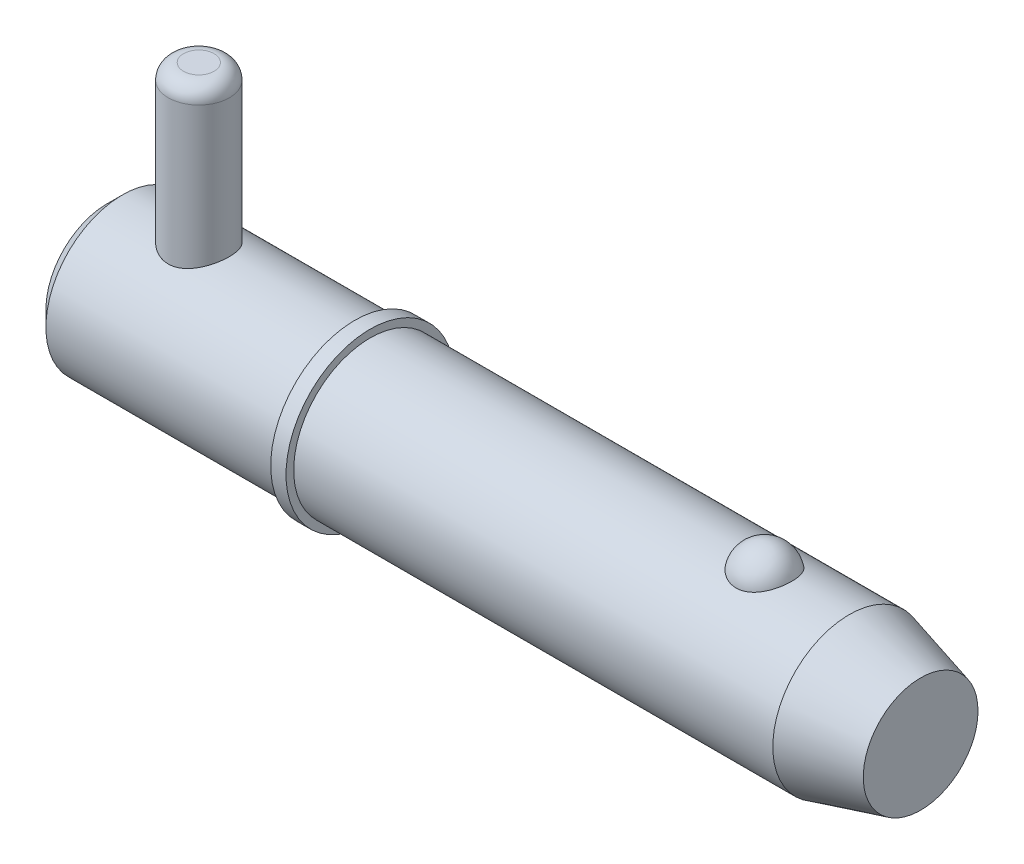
ISO-10303-21;
HEADER;
FILE_DESCRIPTION(('STEP AP214'),'2;1');
FILE_NAME('part.step','',(''),(''),'','','');
FILE_SCHEMA(('AUTOMOTIVE_DESIGN { 1 0 10303 214 1 1 1 1 }'));
ENDSEC;
DATA;
#1=APPLICATION_CONTEXT('core data for automotive mechanical design processes');
#2=APPLICATION_PROTOCOL_DEFINITION('international standard','automotive_design',2000,#1);
#3=PRODUCT_CONTEXT('',#1,'mechanical');
#4=PRODUCT('Part','Part','',(#3));
#5=PRODUCT_RELATED_PRODUCT_CATEGORY('part','',(#4));
#6=PRODUCT_DEFINITION_FORMATION('','',#4);
#7=PRODUCT_DEFINITION_CONTEXT('part definition',#1,'design');
#8=PRODUCT_DEFINITION('design','',#6,#7);
#9=PRODUCT_DEFINITION_SHAPE('','',#8);
#10=(LENGTH_UNIT() NAMED_UNIT(*) SI_UNIT(.MILLI.,.METRE.));
#11=(NAMED_UNIT(*) PLANE_ANGLE_UNIT() SI_UNIT($,.RADIAN.));
#12=(NAMED_UNIT(*) SI_UNIT($,.STERADIAN.) SOLID_ANGLE_UNIT());
#13=UNCERTAINTY_MEASURE_WITH_UNIT(LENGTH_MEASURE(1.E-05),#10,'distance_accuracy_value','');
#14=(GEOMETRIC_REPRESENTATION_CONTEXT(3) GLOBAL_UNCERTAINTY_ASSIGNED_CONTEXT((#13)) GLOBAL_UNIT_ASSIGNED_CONTEXT((#10,
#11,#12)) REPRESENTATION_CONTEXT('',''));
#15=CARTESIAN_POINT('',(0.,0.,0.));
#16=DIRECTION('',(0.,0.,1.));
#17=DIRECTION('',(1.,0.,0.));
#18=AXIS2_PLACEMENT_3D('',#15,#16,#17);
#19=CARTESIAN_POINT('',(9.525,23.81,0.));
#20=DIRECTION('',(0.,-1.,0.));
#21=DIRECTION('',(0.,0.,-1.));
#22=AXIS2_PLACEMENT_3D('',#19,#20,#21);
#23=CYLINDRICAL_SURFACE('',#22,3.175);
#24=CARTESIAN_POINT('',(9.525,-6.3525,0.));
#25=DIRECTION('',(0.,1.,0.));
#26=DIRECTION('',(0.,0.,1.));
#27=AXIS2_PLACEMENT_3D('',#24,#25,#26);
#28=CIRCLE('',#27,3.175);
#29=CARTESIAN_POINT('',(9.525,-6.3525,3.175));
#30=VERTEX_POINT('',#29);
#31=EDGE_CURVE('P0_E25',#30,#30,#28,.T.);
#32=ORIENTED_EDGE('',*,*,#31,.T.);
#33=EDGE_LOOP('',(#32));
#34=FACE_BOUND('',#33,.T.);
#35=CARTESIAN_POINT('',(9.525,22.2225,0.));
#36=DIRECTION('',(0.,1.,0.));
#37=DIRECTION('',(0.,0.,1.));
#38=AXIS2_PLACEMENT_3D('',#35,#36,#37);
#39=CIRCLE('',#38,3.175);
#40=CARTESIAN_POINT('',(9.525,22.2225,3.175));
#41=VERTEX_POINT('',#40);
#42=EDGE_CURVE('P0_E29',#41,#41,#39,.F.);
#43=ORIENTED_EDGE('',*,*,#42,.T.);
#44=EDGE_LOOP('',(#43));
#45=FACE_BOUND('',#44,.T.);
#46=ADVANCED_FACE('P0_F14',(#34,#45),#23,.T.);
#47=CARTESIAN_POINT('',(9.525,23.81,0.));
#48=DIRECTION('',(0.,1.,0.));
#49=DIRECTION('',(0.,0.,1.));
#50=AXIS2_PLACEMENT_3D('',#47,#48,#49);
#51=PLANE('',#50);
#52=CARTESIAN_POINT('',(9.525,23.81,0.));
#53=DIRECTION('',(0.,1.,0.));
#54=DIRECTION('',(0.,0.,1.));
#55=AXIS2_PLACEMENT_3D('',#52,#53,#54);
#56=CIRCLE('',#55,1.5875);
#57=CARTESIAN_POINT('',(9.525,23.81,1.5875));
#58=VERTEX_POINT('',#57);
#59=EDGE_CURVE('P0_E10',#58,#58,#56,.T.);
#60=ORIENTED_EDGE('',*,*,#59,.T.);
#61=EDGE_LOOP('',(#60));
#62=FACE_BOUND('',#61,.T.);
#63=ADVANCED_FACE('P0_F46',(#62),#51,.T.);
#64=CARTESIAN_POINT('',(9.525,-7.94,0.));
#65=DIRECTION('',(0.,1.,0.));
#66=DIRECTION('',(0.,0.,1.));
#67=AXIS2_PLACEMENT_3D('',#64,#65,#66);
#68=PLANE('',#67);
#69=CARTESIAN_POINT('',(9.525,-7.94,0.));
#70=DIRECTION('',(0.,1.,0.));
#71=DIRECTION('',(0.,0.,1.));
#72=AXIS2_PLACEMENT_3D('',#69,#70,#71);
#73=CIRCLE('',#72,1.5875);
#74=CARTESIAN_POINT('',(9.525,-7.94,1.5875));
#75=VERTEX_POINT('',#74);
#76=EDGE_CURVE('P0_E21',#75,#75,#73,.F.);
#77=ORIENTED_EDGE('',*,*,#76,.T.);
#78=EDGE_LOOP('',(#77));
#79=FACE_BOUND('',#78,.T.);
#80=ADVANCED_FACE('P0_F43',(#79),#68,.F.);
#81=CARTESIAN_POINT('',(9.525,-6.3525,0.));
#82=DIRECTION('',(0.,1.,0.));
#83=DIRECTION('',(0.,0.,1.));
#84=AXIS2_PLACEMENT_3D('',#81,#82,#83);
#85=DEGENERATE_TOROIDAL_SURFACE('',#84,1.5875,1.5875,.T.);
#86=ORIENTED_EDGE('',*,*,#76,.F.);
#87=EDGE_LOOP('',(#86));
#88=FACE_BOUND('',#87,.T.);
#89=ORIENTED_EDGE('',*,*,#31,.F.);
#90=EDGE_LOOP('',(#89));
#91=FACE_BOUND('',#90,.T.);
#92=ADVANCED_FACE('P0_F38',(#88,#91),#85,.T.);
#93=CARTESIAN_POINT('',(9.525,22.2225,0.));
#94=DIRECTION('',(0.,1.,0.));
#95=DIRECTION('',(0.,0.,1.));
#96=AXIS2_PLACEMENT_3D('',#93,#94,#95);
#97=DEGENERATE_TOROIDAL_SURFACE('',#96,1.5875,1.5875,.T.);
#98=ORIENTED_EDGE('',*,*,#42,.F.);
#99=EDGE_LOOP('',(#98));
#100=FACE_BOUND('',#99,.T.);
#101=ORIENTED_EDGE('',*,*,#59,.F.);
#102=EDGE_LOOP('',(#101));
#103=FACE_BOUND('',#102,.T.);
#104=ADVANCED_FACE('P0_F16',(#100,#103),#97,.T.);
#105=CLOSED_SHELL('',(#46,#63,#80,#92,#104));
#106=MANIFOLD_SOLID_BREP('P0_B1',#105);
#107=CARTESIAN_POINT('',(0.,0.,0.));
#108=DIRECTION('',(1.,0.,0.));
#109=DIRECTION('',(0.,0.,-1.));
#110=AXIS2_PLACEMENT_3D('',#107,#108,#109);
#111=CYLINDRICAL_SURFACE('',#110,7.94);
#112=CARTESIAN_POINT('',(77.0518791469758,0.,0.));
#113=DIRECTION('',(1.,0.,0.));
#114=DIRECTION('',(0.,0.,-1.));
#115=AXIS2_PLACEMENT_3D('',#112,#113,#114);
#116=CIRCLE('',#115,7.94);
#117=CARTESIAN_POINT('',(77.0518791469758,0.,-7.94));
#118=VERTEX_POINT('',#117);
#119=EDGE_CURVE('P1_E81',#118,#118,#116,.T.);
#120=ORIENTED_EDGE('',*,*,#119,.F.);
#121=EDGE_LOOP('',(#120));
#122=FACE_BOUND('',#121,.T.);
#123=CARTESIAN_POINT('',(27.31,0.,0.));
#124=DIRECTION('',(1.,0.,0.));
#125=DIRECTION('',(0.,0.,-1.));
#126=AXIS2_PLACEMENT_3D('',#123,#124,#125);
#127=CIRCLE('',#126,7.94);
#128=CARTESIAN_POINT('',(27.31,0.,-7.94));
#129=VERTEX_POINT('',#128);
#130=EDGE_CURVE('P1_E85',#129,#129,#127,.T.);
#131=ORIENTED_EDGE('',*,*,#130,.T.);
#132=EDGE_LOOP('',(#131));
#133=FACE_BOUND('',#132,.T.);
#134=CARTESIAN_POINT('',(68.2449074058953,7.37767842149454,2.93486986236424));
#135=CARTESIAN_POINT('',(68.0927496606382,7.37767329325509,2.9348750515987));
#136=CARTESIAN_POINT('',(67.9406329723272,7.38258419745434,2.92262454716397));
#137=CARTESIAN_POINT('',(67.6409284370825,7.40163229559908,2.87404196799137));
#138=CARTESIAN_POINT('',(67.4933394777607,7.41576720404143,2.83771585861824));
#139=CARTESIAN_POINT('',(67.2070187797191,7.45161576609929,2.74218769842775));
#140=CARTESIAN_POINT('',(67.0682745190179,7.47331841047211,2.68301886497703));
#141=CARTESIAN_POINT('',(66.8028822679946,7.52194082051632,2.54350967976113));
#142=CARTESIAN_POINT('',(66.6762366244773,7.54886159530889,2.46316523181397));
#143=CARTESIAN_POINT('',(66.4345349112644,7.60594671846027,2.28090375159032));
#144=CARTESIAN_POINT('',(66.3199065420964,7.63618114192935,2.1784421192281));
#145=CARTESIAN_POINT('',(66.1088787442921,7.69614046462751,1.95608495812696));
#146=CARTESIAN_POINT('',(66.0124826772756,7.72586526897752,1.83618622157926));
#147=CARTESIAN_POINT('',(65.8359381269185,7.78314821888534,1.57628086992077));
#148=CARTESIAN_POINT('',(65.7567072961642,7.81055035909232,1.43561546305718));
#149=CARTESIAN_POINT('',(65.6217979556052,7.85879631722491,1.14236334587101));
#150=CARTESIAN_POINT('',(65.5661216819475,7.87963951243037,0.98977550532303));
#151=CARTESIAN_POINT('',(65.4788121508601,7.91289645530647,0.674619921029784));
#152=CARTESIAN_POINT('',(65.4475309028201,7.92518652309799,0.511941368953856));
#153=CARTESIAN_POINT('',(65.4109756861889,7.93958930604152,0.18324773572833));
#154=CARTESIAN_POINT('',(65.4057012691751,7.94170219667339,0.0172327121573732));
#155=CARTESIAN_POINT('',(65.4212311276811,7.93554931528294,-0.312672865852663));
#156=CARTESIAN_POINT('',(65.4419253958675,7.92732732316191,-0.476569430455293));
#157=CARTESIAN_POINT('',(65.5087865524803,7.90141534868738,-0.798305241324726));
#158=CARTESIAN_POINT('',(65.5549539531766,7.88372517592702,-0.95614436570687));
#159=CARTESIAN_POINT('',(65.6718986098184,7.84066230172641,-1.26152073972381));
#160=CARTESIAN_POINT('',(65.7427046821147,7.81528060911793,-1.40904568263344));
#161=CARTESIAN_POINT('',(65.9074789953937,7.7594867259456,-1.68950598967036));
#162=CARTESIAN_POINT('',(66.0014488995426,7.72907417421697,-1.82244030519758));
#163=CARTESIAN_POINT('',(66.2108391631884,7.66640424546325,-2.07032792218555));
#164=CARTESIAN_POINT('',(66.3263152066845,7.63414223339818,-2.1852330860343));
#165=CARTESIAN_POINT('',(66.5759006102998,7.57149681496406,-2.39329737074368));
#166=CARTESIAN_POINT('',(66.7100080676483,7.54111321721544,-2.48645870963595));
#167=CARTESIAN_POINT('',(66.9901113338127,7.48650742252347,-2.64628132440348));
#168=CARTESIAN_POINT('',(67.1357605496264,7.46215900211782,-2.71350554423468));
#169=CARTESIAN_POINT('',(67.4374259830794,7.42171253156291,-2.82226614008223));
#170=CARTESIAN_POINT('',(67.5934383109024,7.40561140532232,-2.86381209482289));
#171=CARTESIAN_POINT('',(67.9029708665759,7.3842679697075,-2.91839077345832));
#172=CARTESIAN_POINT('',(68.0562229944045,7.37852109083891,-2.93275024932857));
#173=CARTESIAN_POINT('',(68.3630705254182,7.37700973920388,-2.93655208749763));
#174=CARTESIAN_POINT('',(68.5166658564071,7.38124333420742,-2.92599927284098));
#175=CARTESIAN_POINT('',(68.8149907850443,7.39890635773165,-2.88102897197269));
#176=CARTESIAN_POINT('',(68.9598480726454,7.41205491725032,-2.84733999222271));
#177=CARTESIAN_POINT('',(69.2416432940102,7.44580110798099,-2.75788206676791));
#178=CARTESIAN_POINT('',(69.3785805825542,7.46639934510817,-2.70211132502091));
#179=CARTESIAN_POINT('',(69.6440619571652,7.51339098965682,-2.56858908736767));
#180=CARTESIAN_POINT('',(69.7723548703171,7.5399020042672,-2.49038067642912));
#181=CARTESIAN_POINT('',(70.0142440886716,7.59569503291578,-2.31462737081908));
#182=CARTESIAN_POINT('',(70.1278370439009,7.6249776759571,-2.21707808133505));
#183=CARTESIAN_POINT('',(70.34322156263,7.68489473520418,-1.99982049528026));
#184=CARTESIAN_POINT('',(70.4441488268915,7.71552419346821,-1.87925337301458));
#185=CARTESIAN_POINT('',(70.6251866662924,7.77353016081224,-1.62268826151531));
#186=CARTESIAN_POINT('',(70.7052934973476,7.80090608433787,-1.48668750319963));
#187=CARTESIAN_POINT('',(70.8453615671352,7.85047992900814,-1.19818413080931));
#188=CARTESIAN_POINT('',(70.9045877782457,7.87248183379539,-1.04529016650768));
#189=CARTESIAN_POINT('',(70.9979821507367,7.90785114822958,-0.731080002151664));
#190=CARTESIAN_POINT('',(71.0321497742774,7.92121837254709,-0.569763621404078));
#191=CARTESIAN_POINT('',(71.074795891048,7.93797834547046,-0.24281228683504));
#192=CARTESIAN_POINT('',(71.0832047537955,7.94134405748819,-0.0771668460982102));
#193=CARTESIAN_POINT('',(71.0739626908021,7.93767937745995,0.253276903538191));
#194=CARTESIAN_POINT('',(71.0563120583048,7.93064910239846,0.418075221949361));
#195=CARTESIAN_POINT('',(70.995424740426,7.90695571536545,0.74152553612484));
#196=CARTESIAN_POINT('',(70.9522819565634,7.8903279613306,0.900197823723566));
#197=CARTESIAN_POINT('',(70.8413535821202,7.84916386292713,1.20759654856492));
#198=CARTESIAN_POINT('',(70.77356656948,7.82462706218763,1.35632241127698));
#199=CARTESIAN_POINT('',(70.6143718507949,7.7700669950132,1.64032869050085));
#200=CARTESIAN_POINT('',(70.5228616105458,7.7400200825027,1.77554712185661));
#201=CARTESIAN_POINT('',(70.3182960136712,7.67774175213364,2.02800648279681));
#202=CARTESIAN_POINT('',(70.2052410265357,7.64551037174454,2.14524772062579));
#203=CARTESIAN_POINT('',(69.9608318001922,7.58265895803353,2.35778002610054));
#204=CARTESIAN_POINT('',(69.8295833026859,7.55203092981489,2.45319004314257));
#205=CARTESIAN_POINT('',(69.551601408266,7.49579792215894,2.61999897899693));
#206=CARTESIAN_POINT('',(69.4048670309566,7.47019326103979,2.69139637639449));
#207=CARTESIAN_POINT('',(69.0929477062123,7.42622216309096,2.81053241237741));
#208=CARTESIAN_POINT('',(68.9272209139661,7.40825002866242,2.85700910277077));
#209=CARTESIAN_POINT('',(68.5892792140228,7.38398348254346,2.91916850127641));
#210=CARTESIAN_POINT('',(68.4170670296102,7.37768422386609,2.93486399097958));
#211=CARTESIAN_POINT('',(68.2449074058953,7.37767842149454,2.93486986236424));
#212=B_SPLINE_CURVE_WITH_KNOTS('',3,(#134,#135,#136,#137,#138,#139,#140,#141,#142,#143,#144,
#145,#146,#147,#148,#149,#150,#151,#152,#153,#154,#155,#156,#157,#158,#159,#160,#161,#162,#163,
#164,#165,#166,#167,#168,#169,#170,#171,#172,#173,#174,#175,#176,#177,#178,#179,#180,#181,#182,
#183,#184,#185,#186,#187,#188,#189,#190,#191,#192,#193,#194,#195,#196,#197,#198,#199,#200,#201,
#202,#203,#204,#205,#206,#207,#208,#209,#210,#211),.UNSPECIFIED.,.T.,.F.,(4,2,2,2,2,2,2,2,2,2,2,
2,2,2,2,2,2,2,2,2,2,2,2,2,2,2,2,2,2,2,2,2,2,2,2,2,2,2,4),(0.,0.455841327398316,
0.911569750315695,1.36663794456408,1.82179423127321,2.28978983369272,2.75787163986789,
3.246853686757,3.73588214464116,4.23184282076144,4.72779494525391,5.22165321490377,
5.71552141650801,6.20996917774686,6.70445245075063,7.200234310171,7.69596557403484,
8.18023418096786,8.66432203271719,9.12410697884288,9.58380291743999,10.0296503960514,
10.475534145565,10.9312349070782,11.3870393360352,11.8654416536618,12.3439299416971,
12.8378875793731,13.3318558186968,13.8271581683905,14.3224549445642,14.8159385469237,
15.3094506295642,15.8051323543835,16.3008055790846,16.7937101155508,17.2866458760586,
17.8026240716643,18.3183879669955),.UNSPECIFIED.);
#213=CARTESIAN_POINT('',(68.2449074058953,7.37767842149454,2.93486986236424));
#214=VERTEX_POINT('',#213);
#215=EDGE_CURVE('P1_E35',#214,#214,#212,.T.);
#216=ORIENTED_EDGE('',*,*,#215,.T.);
#217=EDGE_LOOP('',(#216));
#218=FACE_BOUND('',#217,.T.);
#219=ADVANCED_FACE('P1_F13',(#122,#133,#218),#111,.T.);
#220=CARTESIAN_POINT('',(0.,0.,0.));
#221=DIRECTION('',(-1.,0.,0.));
#222=DIRECTION('',(0.,0.,1.));
#223=AXIS2_PLACEMENT_3D('',#220,#221,#222);
#224=PLANE('',#223);
#225=CARTESIAN_POINT('',(0.,0.,0.));
#226=DIRECTION('',(1.,0.,0.));
#227=DIRECTION('',(0.,0.,-1.));
#228=AXIS2_PLACEMENT_3D('',#225,#226,#227);
#229=CIRCLE('',#228,6.352);
#230=CARTESIAN_POINT('',(0.,0.,-6.352));
#231=VERTEX_POINT('',#230);
#232=EDGE_CURVE('P1_E9',#231,#231,#229,.T.);
#233=ORIENTED_EDGE('',*,*,#232,.F.);
#234=EDGE_LOOP('',(#233));
#235=FACE_BOUND('',#234,.T.);
#236=ADVANCED_FACE('P1_F15',(#235),#224,.T.);
#237=CARTESIAN_POINT('',(1.58799999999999,0.,0.));
#238=DIRECTION('',(1.,0.,0.));
#239=DIRECTION('',(0.,0.,-1.));
#240=AXIS2_PLACEMENT_3D('',#237,#238,#239);
#241=CONICAL_SURFACE('',#240,7.94,0.78539816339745);
#242=ORIENTED_EDGE('',*,*,#232,.T.);
#243=EDGE_LOOP('',(#242));
#244=FACE_BOUND('',#243,.T.);
#245=CARTESIAN_POINT('',(1.58799999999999,0.,0.));
#246=DIRECTION('',(1.,0.,0.));
#247=DIRECTION('',(0.,0.,-1.));
#248=AXIS2_PLACEMENT_3D('',#245,#246,#247);
#249=CIRCLE('',#248,7.94);
#250=CARTESIAN_POINT('',(1.58799999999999,0.,-7.94));
#251=VERTEX_POINT('',#250);
#252=EDGE_CURVE('P1_E26',#251,#251,#249,.T.);
#253=ORIENTED_EDGE('',*,*,#252,.F.);
#254=EDGE_LOOP('',(#253));
#255=FACE_BOUND('',#254,.T.);
#256=ADVANCED_FACE('P1_F77',(#244,#255),#241,.T.);
#257=CARTESIAN_POINT('',(0.,0.,0.));
#258=DIRECTION('',(1.,0.,0.));
#259=DIRECTION('',(0.,0.,-1.));
#260=AXIS2_PLACEMENT_3D('',#257,#258,#259);
#261=CYLINDRICAL_SURFACE('',#260,7.94);
#262=CARTESIAN_POINT('',(9.525,-7.27756655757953,3.175));
#263=CARTESIAN_POINT('',(9.43992346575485,-7.27756715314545,3.17499935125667));
#264=CARTESIAN_POINT('',(9.35481882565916,-7.27906496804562,3.1715736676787));
#265=CARTESIAN_POINT('',(9.18524505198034,-7.28499816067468,3.15791803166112));
#266=CARTESIAN_POINT('',(9.100776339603,-7.28943533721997,3.14768391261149));
#267=CARTESIAN_POINT('',(8.84895715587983,-7.30698881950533,3.10684226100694));
#268=CARTESIAN_POINT('',(8.6834173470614,-7.32434654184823,3.06609574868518));
#269=CARTESIAN_POINT('',(8.36278910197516,-7.36806950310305,2.95945910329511));
#270=CARTESIAN_POINT('',(8.20766386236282,-7.39440078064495,2.89366366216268));
#271=CARTESIAN_POINT('',(7.91065319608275,-7.45304562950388,2.73907413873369));
#272=CARTESIAN_POINT('',(7.76876488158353,-7.48535789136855,2.65028508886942));
#273=CARTESIAN_POINT('',(7.49411086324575,-7.55439482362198,2.44679888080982));
#274=CARTESIAN_POINT('',(7.36219910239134,-7.59126138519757,2.33099745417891));
#275=CARTESIAN_POINT('',(7.11904234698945,-7.66408045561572,2.07909838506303));
#276=CARTESIAN_POINT('',(7.00780457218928,-7.70003264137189,1.94299368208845));
#277=CARTESIAN_POINT('',(6.80492173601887,-7.76867514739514,1.64775981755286));
#278=CARTESIAN_POINT('',(6.71422139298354,-7.80118112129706,1.48793473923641));
#279=CARTESIAN_POINT('',(6.56135788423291,-7.85754918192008,1.15376269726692));
#280=CARTESIAN_POINT('',(6.49918311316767,-7.88141478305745,0.979421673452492));
#281=CARTESIAN_POINT('',(6.40818142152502,-7.91680873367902,0.630115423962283));
#282=CARTESIAN_POINT('',(6.3778864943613,-7.9288781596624,0.455588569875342));
#283=CARTESIAN_POINT('',(6.34677743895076,-7.94127547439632,0.103539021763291));
#284=CARTESIAN_POINT('',(6.34595232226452,-7.94160773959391,-0.0739825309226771));
#285=CARTESIAN_POINT('',(6.37300128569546,-7.93082261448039,-0.416371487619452));
#286=CARTESIAN_POINT('',(6.39926693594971,-7.92034690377,-0.581389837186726));
#287=CARTESIAN_POINT('',(6.47701615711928,-7.88998770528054,-0.904449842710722));
#288=CARTESIAN_POINT('',(6.52850157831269,-7.87010352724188,-1.06249098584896));
#289=CARTESIAN_POINT('',(6.65586120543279,-7.82249343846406,-1.36995769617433));
#290=CARTESIAN_POINT('',(6.73209124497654,-7.79465387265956,-1.51921754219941));
#291=CARTESIAN_POINT('',(6.90644286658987,-7.73389606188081,-1.80321183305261));
#292=CARTESIAN_POINT('',(7.00457194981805,-7.70097607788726,-1.93794127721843));
#293=CARTESIAN_POINT('',(7.22744086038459,-7.63084889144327,-2.19843606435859));
#294=CARTESIAN_POINT('',(7.35350432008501,-7.59350211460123,-2.3230330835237));
#295=CARTESIAN_POINT('',(7.62488266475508,-7.52039654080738,-2.54979642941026));
#296=CARTESIAN_POINT('',(7.77020381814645,-7.48463826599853,-2.65195542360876));
#297=CARTESIAN_POINT('',(8.08119298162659,-7.41780943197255,-2.83361305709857));
#298=CARTESIAN_POINT('',(8.24731937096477,-7.38689959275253,-2.91239105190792));
#299=CARTESIAN_POINT('',(8.59204539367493,-7.33515216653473,-3.04038913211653));
#300=CARTESIAN_POINT('',(8.77063684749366,-7.31430804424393,-3.08962840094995));
#301=CARTESIAN_POINT('',(9.12356982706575,-7.28663831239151,-3.15431018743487));
#302=CARTESIAN_POINT('',(9.29750494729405,-7.2790344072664,-3.17163284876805));
#303=CARTESIAN_POINT('',(9.64592502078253,-7.27648884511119,-3.17747282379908));
#304=CARTESIAN_POINT('',(9.82040979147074,-7.28154335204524,-3.16599886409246));
#305=CARTESIAN_POINT('',(10.1545374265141,-7.30294638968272,-3.11628310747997));
#306=CARTESIAN_POINT('',(10.3144598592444,-7.31863587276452,-3.0796016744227));
#307=CARTESIAN_POINT('',(10.625774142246,-7.35872371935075,-2.98253618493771));
#308=CARTESIAN_POINT('',(10.7771640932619,-7.38312401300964,-2.92214687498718));
#309=CARTESIAN_POINT('',(11.0739599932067,-7.4390944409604,-2.77664664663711));
#310=CARTESIAN_POINT('',(11.2188745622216,-7.47091513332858,-2.69063278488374));
#311=CARTESIAN_POINT('',(11.4928722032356,-7.53775867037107,-2.49724834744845));
#312=CARTESIAN_POINT('',(11.6219487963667,-7.57278281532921,-2.38986907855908));
#313=CARTESIAN_POINT('',(11.8705091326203,-7.64520845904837,-2.1474449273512));
#314=CARTESIAN_POINT('',(11.9885816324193,-7.68259462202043,-2.01094304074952));
#315=CARTESIAN_POINT('',(12.2003631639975,-7.75309951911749,-1.71917041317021));
#316=CARTESIAN_POINT('',(12.2940712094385,-7.78621808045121,-1.56389891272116));
#317=CARTESIAN_POINT('',(12.4541161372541,-7.84456050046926,-1.23845027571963));
#318=CARTESIAN_POINT('',(12.5204600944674,-7.86978639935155,-1.06827700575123));
#319=CARTESIAN_POINT('',(12.6231407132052,-7.90943635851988,-0.717928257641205));
#320=CARTESIAN_POINT('',(12.6594936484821,-7.92386627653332,-0.537758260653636));
#321=CARTESIAN_POINT('',(12.6992281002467,-7.93967263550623,-0.185201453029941));
#322=CARTESIAN_POINT('',(12.7046050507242,-7.94183891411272,-0.0130732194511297));
#323=CARTESIAN_POINT('',(12.6875036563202,-7.9350072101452,0.329549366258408));
#324=CARTESIAN_POINT('',(12.6650295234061,-7.92601091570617,0.500043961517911));
#325=CARTESIAN_POINT('',(12.5942896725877,-7.89825976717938,0.829196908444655));
#326=CARTESIAN_POINT('',(12.5468364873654,-7.87981280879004,0.988057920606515));
#327=CARTESIAN_POINT('',(12.4283390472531,-7.83513565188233,1.29553461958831));
#328=CARTESIAN_POINT('',(12.3572904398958,-7.8089040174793,1.44414841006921));
#329=CARTESIAN_POINT('',(12.1900822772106,-7.7497911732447,1.73412879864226));
#330=CARTESIAN_POINT('',(12.0929519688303,-7.71666737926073,1.87488510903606));
#331=CARTESIAN_POINT('',(11.8777894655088,-7.64775894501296,2.13869231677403));
#332=CARTESIAN_POINT('',(11.7597486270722,-7.61197320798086,2.26173585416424));
#333=CARTESIAN_POINT('',(11.4974896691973,-7.53902341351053,2.49449755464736));
#334=CARTESIAN_POINT('',(11.3521039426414,-7.50191102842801,2.60292060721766));
#335=CARTESIAN_POINT('',(11.0440201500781,-7.43289551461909,2.79392602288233));
#336=CARTESIAN_POINT('',(10.8813200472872,-7.40099299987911,2.87650534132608));
#337=CARTESIAN_POINT('',(10.558064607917,-7.3489506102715,3.00682739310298));
#338=CARTESIAN_POINT('',(10.398627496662,-7.32801197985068,3.05703164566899));
#339=CARTESIAN_POINT('',(10.0731242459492,-7.29639491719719,3.13175843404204));
#340=CARTESIAN_POINT('',(9.90707793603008,-7.28568789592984,3.15635254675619));
#341=CARTESIAN_POINT('',(9.70441566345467,-7.27968826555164,3.17013149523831));
#342=CARTESIAN_POINT('',(9.66856669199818,-7.27889378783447,3.17195593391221));
#343=CARTESIAN_POINT('',(9.59681348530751,-7.27783278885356,3.17439036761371));
#344=CARTESIAN_POINT('',(9.56090924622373,-7.27756630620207,3.17500027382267));
#345=CARTESIAN_POINT('',(9.525,-7.27756655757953,3.175));
#346=B_SPLINE_CURVE_WITH_KNOTS('',3,(#262,#263,#264,#265,#266,#267,#268,#269,#270,#271,#272,
#273,#274,#275,#276,#277,#278,#279,#280,#281,#282,#283,#284,#285,#286,#287,#288,#289,#290,#291,
#292,#293,#294,#295,#296,#297,#298,#299,#300,#301,#302,#303,#304,#305,#306,#307,#308,#309,#310,
#311,#312,#313,#314,#315,#316,#317,#318,#319,#320,#321,#322,#323,#324,#325,#326,#327,#328,#329,
#330,#331,#332,#333,#334,#335,#336,#337,#338,#339,#340,#341,#342,#343,#344,#345),.UNSPECIFIED.,
.T.,.F.,(4,2,2,2,2,2,2,2,2,2,2,2,2,2,2,2,2,2,2,2,2,2,2,2,2,2,2,2,2,2,2,2,2,2,2,2,2,2,2,2,2,4),
(0.,0.255187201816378,0.510530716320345,1.0218798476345,1.53131482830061,2.04063840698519,
2.57635929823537,3.11226692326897,3.66929090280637,4.22608806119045,4.75594400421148,
5.28560237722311,5.78552836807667,6.28549104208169,6.79298787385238,7.30065880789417,
7.8416422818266,8.38280228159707,8.93923025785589,9.49529647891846,10.0174074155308,
10.5393601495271,11.0316114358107,11.5239718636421,12.0362920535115,12.5488211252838,
13.0991799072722,13.6495609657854,14.1997996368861,14.7497395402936,15.2638187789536,
15.7778202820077,16.2760504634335,16.7743726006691,17.294711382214,17.8152657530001,
18.3680208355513,18.9208410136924,19.4240423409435,19.9258334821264,20.0335354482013,
20.1412452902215),.UNSPECIFIED.);
#347=CARTESIAN_POINT('',(9.525,-7.27756655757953,3.175));
#348=VERTEX_POINT('',#347);
#349=EDGE_CURVE('P1_E17',#348,#348,#346,.T.);
#350=ORIENTED_EDGE('',*,*,#349,.F.);
#351=EDGE_LOOP('',(#350));
#352=FACE_BOUND('',#351,.T.);
#353=CARTESIAN_POINT('',(9.525,7.27756655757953,3.175));
#354=CARTESIAN_POINT('',(9.61007653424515,7.27756715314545,3.17499935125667));
#355=CARTESIAN_POINT('',(9.69518117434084,7.27906496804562,3.1715736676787));
#356=CARTESIAN_POINT('',(9.86475494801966,7.28499816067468,3.15791803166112));
#357=CARTESIAN_POINT('',(9.949223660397,7.28943533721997,3.14768391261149));
#358=CARTESIAN_POINT('',(10.2010428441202,7.30698881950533,3.10684226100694));
#359=CARTESIAN_POINT('',(10.3665826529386,7.32434654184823,3.06609574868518));
#360=CARTESIAN_POINT('',(10.6872108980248,7.36806950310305,2.95945910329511));
#361=CARTESIAN_POINT('',(10.8423361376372,7.39440078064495,2.89366366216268));
#362=CARTESIAN_POINT('',(11.1393468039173,7.45304562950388,2.73907413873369));
#363=CARTESIAN_POINT('',(11.2812351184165,7.48535789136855,2.65028508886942));
#364=CARTESIAN_POINT('',(11.5558891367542,7.55439482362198,2.44679888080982));
#365=CARTESIAN_POINT('',(11.6878008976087,7.59126138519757,2.33099745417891));
#366=CARTESIAN_POINT('',(11.9309576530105,7.66408045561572,2.07909838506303));
#367=CARTESIAN_POINT('',(12.0421954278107,7.70003264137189,1.94299368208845));
#368=CARTESIAN_POINT('',(12.2450782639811,7.76867514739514,1.64775981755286));
#369=CARTESIAN_POINT('',(12.3357786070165,7.80118112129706,1.48793473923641));
#370=CARTESIAN_POINT('',(12.4886421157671,7.85754918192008,1.15376269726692));
#371=CARTESIAN_POINT('',(12.5508168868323,7.88141478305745,0.979421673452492));
#372=CARTESIAN_POINT('',(12.641818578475,7.91680873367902,0.630115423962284));
#373=CARTESIAN_POINT('',(12.6721135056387,7.9288781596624,0.455588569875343));
#374=CARTESIAN_POINT('',(12.7032225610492,7.94127547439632,0.103539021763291));
#375=CARTESIAN_POINT('',(12.7040476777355,7.94160773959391,-0.0739825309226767));
#376=CARTESIAN_POINT('',(12.6769987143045,7.93082261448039,-0.416371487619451));
#377=CARTESIAN_POINT('',(12.6507330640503,7.92034690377,-0.581389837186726));
#378=CARTESIAN_POINT('',(12.5729838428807,7.88998770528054,-0.904449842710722));
#379=CARTESIAN_POINT('',(12.5214984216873,7.87010352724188,-1.06249098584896));
#380=CARTESIAN_POINT('',(12.3941387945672,7.82249343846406,-1.36995769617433));
#381=CARTESIAN_POINT('',(12.3179087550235,7.79465387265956,-1.51921754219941));
#382=CARTESIAN_POINT('',(12.1435571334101,7.73389606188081,-1.80321183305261));
#383=CARTESIAN_POINT('',(12.0454280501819,7.70097607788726,-1.93794127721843));
#384=CARTESIAN_POINT('',(11.8225591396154,7.63084889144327,-2.19843606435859));
#385=CARTESIAN_POINT('',(11.696495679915,7.59350211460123,-2.3230330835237));
#386=CARTESIAN_POINT('',(11.4251173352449,7.52039654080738,-2.54979642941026));
#387=CARTESIAN_POINT('',(11.2797961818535,7.48463826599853,-2.65195542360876));
#388=CARTESIAN_POINT('',(10.9688070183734,7.41780943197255,-2.83361305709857));
#389=CARTESIAN_POINT('',(10.8026806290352,7.38689959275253,-2.91239105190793));
#390=CARTESIAN_POINT('',(10.4579546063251,7.33515216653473,-3.04038913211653));
#391=CARTESIAN_POINT('',(10.2793631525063,7.31430804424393,-3.08962840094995));
#392=CARTESIAN_POINT('',(9.92643017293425,7.28663831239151,-3.15431018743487));
#393=CARTESIAN_POINT('',(9.75249505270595,7.2790344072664,-3.17163284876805));
#394=CARTESIAN_POINT('',(9.40407497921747,7.2764888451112,-3.17747282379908));
#395=CARTESIAN_POINT('',(9.22959020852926,7.28154335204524,-3.16599886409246));
#396=CARTESIAN_POINT('',(8.89546257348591,7.30294638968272,-3.11628310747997));
#397=CARTESIAN_POINT('',(8.73554014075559,7.31863587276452,-3.0796016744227));
#398=CARTESIAN_POINT('',(8.42422585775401,7.35872371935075,-2.98253618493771));
#399=CARTESIAN_POINT('',(8.27283590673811,7.38312401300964,-2.92214687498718));
#400=CARTESIAN_POINT('',(7.97604000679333,7.4390944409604,-2.77664664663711));
#401=CARTESIAN_POINT('',(7.83112543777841,7.47091513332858,-2.69063278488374));
#402=CARTESIAN_POINT('',(7.55712779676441,7.53775867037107,-2.49724834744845));
#403=CARTESIAN_POINT('',(7.42805120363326,7.57278281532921,-2.38986907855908));
#404=CARTESIAN_POINT('',(7.17949086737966,7.64520845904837,-2.1474449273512));
#405=CARTESIAN_POINT('',(7.06141836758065,7.68259462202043,-2.01094304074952));
#406=CARTESIAN_POINT('',(6.8496368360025,7.75309951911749,-1.71917041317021));
#407=CARTESIAN_POINT('',(6.75592879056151,7.78621808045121,-1.56389891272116));
#408=CARTESIAN_POINT('',(6.59588386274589,7.84456050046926,-1.23845027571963));
#409=CARTESIAN_POINT('',(6.52953990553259,7.86978639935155,-1.06827700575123));
#410=CARTESIAN_POINT('',(6.42685928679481,7.90943635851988,-0.717928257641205));
#411=CARTESIAN_POINT('',(6.39050635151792,7.92386627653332,-0.537758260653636));
#412=CARTESIAN_POINT('',(6.35077189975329,7.93967263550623,-0.18520145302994));
#413=CARTESIAN_POINT('',(6.34539494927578,7.94183891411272,-0.0130732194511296));
#414=CARTESIAN_POINT('',(6.36249634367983,7.9350072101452,0.329549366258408));
#415=CARTESIAN_POINT('',(6.38497047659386,7.92601091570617,0.500043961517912));
#416=CARTESIAN_POINT('',(6.45571032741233,7.89825976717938,0.829196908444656));
#417=CARTESIAN_POINT('',(6.50316351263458,7.87981280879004,0.988057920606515));
#418=CARTESIAN_POINT('',(6.62166095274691,7.83513565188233,1.29553461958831));
#419=CARTESIAN_POINT('',(6.69270956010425,7.8089040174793,1.44414841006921));
#420=CARTESIAN_POINT('',(6.85991772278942,7.7497911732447,1.73412879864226));
#421=CARTESIAN_POINT('',(6.95704803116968,7.71666737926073,1.87488510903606));
#422=CARTESIAN_POINT('',(7.17221053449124,7.64775894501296,2.13869231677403));
#423=CARTESIAN_POINT('',(7.29025137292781,7.61197320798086,2.26173585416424));
#424=CARTESIAN_POINT('',(7.55251033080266,7.53902341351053,2.49449755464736));
#425=CARTESIAN_POINT('',(7.69789605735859,7.50191102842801,2.60292060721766));
#426=CARTESIAN_POINT('',(8.00597984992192,7.43289551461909,2.79392602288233));
#427=CARTESIAN_POINT('',(8.16867995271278,7.40099299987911,2.87650534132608));
#428=CARTESIAN_POINT('',(8.49193539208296,7.3489506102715,3.00682739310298));
#429=CARTESIAN_POINT('',(8.65137250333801,7.32801197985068,3.05703164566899));
#430=CARTESIAN_POINT('',(8.97687575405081,7.29639491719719,3.13175843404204));
#431=CARTESIAN_POINT('',(9.14292206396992,7.28568789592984,3.15635254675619));
#432=CARTESIAN_POINT('',(9.34558433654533,7.27968826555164,3.17013149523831));
#433=CARTESIAN_POINT('',(9.38143330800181,7.27889378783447,3.17195593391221));
#434=CARTESIAN_POINT('',(9.45318651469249,7.27783278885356,3.17439036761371));
#435=CARTESIAN_POINT('',(9.48909075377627,7.27756630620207,3.17500027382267));
#436=CARTESIAN_POINT('',(9.525,7.27756655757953,3.175));
#437=B_SPLINE_CURVE_WITH_KNOTS('',3,(#353,#354,#355,#356,#357,#358,#359,#360,#361,#362,#363,
#364,#365,#366,#367,#368,#369,#370,#371,#372,#373,#374,#375,#376,#377,#378,#379,#380,#381,#382,
#383,#384,#385,#386,#387,#388,#389,#390,#391,#392,#393,#394,#395,#396,#397,#398,#399,#400,#401,
#402,#403,#404,#405,#406,#407,#408,#409,#410,#411,#412,#413,#414,#415,#416,#417,#418,#419,#420,
#421,#422,#423,#424,#425,#426,#427,#428,#429,#430,#431,#432,#433,#434,#435,#436),.UNSPECIFIED.,
.T.,.F.,(4,2,2,2,2,2,2,2,2,2,2,2,2,2,2,2,2,2,2,2,2,2,2,2,2,2,2,2,2,2,2,2,2,2,2,2,2,2,2,2,2,4),
(0.,0.255187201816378,0.510530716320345,1.0218798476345,1.53131482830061,2.04063840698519,
2.57635929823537,3.11226692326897,3.66929090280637,4.22608806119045,4.75594400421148,
5.2856023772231,5.78552836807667,6.28549104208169,6.79298787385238,7.30065880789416,
7.8416422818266,8.38280228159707,8.9392302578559,9.49529647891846,10.0174074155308,
10.5393601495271,11.0316114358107,11.5239718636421,12.0362920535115,12.5488211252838,
13.0991799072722,13.6495609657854,14.1997996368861,14.7497395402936,15.2638187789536,
15.7778202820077,16.2760504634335,16.7743726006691,17.294711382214,17.8152657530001,
18.3680208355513,18.9208410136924,19.4240423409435,19.9258334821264,20.0335354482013,
20.1412452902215),.UNSPECIFIED.);
#438=CARTESIAN_POINT('',(9.525,7.27756655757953,3.175));
#439=VERTEX_POINT('',#438);
#440=EDGE_CURVE('P1_E43',#439,#439,#437,.T.);
#441=ORIENTED_EDGE('',*,*,#440,.F.);
#442=EDGE_LOOP('',(#441));
#443=FACE_BOUND('',#442,.T.);
#444=ORIENTED_EDGE('',*,*,#252,.T.);
#445=EDGE_LOOP('',(#444));
#446=FACE_BOUND('',#445,.T.);
#447=CARTESIAN_POINT('',(25.722,0.,0.));
#448=DIRECTION('',(1.,0.,0.));
#449=DIRECTION('',(0.,0.,-1.));
#450=AXIS2_PLACEMENT_3D('',#447,#448,#449);
#451=CIRCLE('',#450,7.94);
#452=CARTESIAN_POINT('',(25.722,0.,-7.94));
#453=VERTEX_POINT('',#452);
#454=EDGE_CURVE('P1_E31',#453,#453,#451,.T.);
#455=ORIENTED_EDGE('',*,*,#454,.F.);
#456=EDGE_LOOP('',(#455));
#457=FACE_BOUND('',#456,.T.);
#458=ADVANCED_FACE('P1_F103',(#352,#443,#446,#457),#261,.T.);
#459=CARTESIAN_POINT('',(25.722,7.94,0.));
#460=DIRECTION('',(-1.,0.,0.));
#461=DIRECTION('',(0.,0.,1.));
#462=AXIS2_PLACEMENT_3D('',#459,#460,#461);
#463=PLANE('',#462);
#464=ORIENTED_EDGE('',*,*,#454,.T.);
#465=EDGE_LOOP('',(#464));
#466=FACE_BOUND('',#465,.T.);
#467=CARTESIAN_POINT('',(25.722,0.,0.));
#468=DIRECTION('',(1.,0.,0.));
#469=DIRECTION('',(0.,0.,-1.));
#470=AXIS2_PLACEMENT_3D('',#467,#468,#469);
#471=CIRCLE('',#470,8.734);
#472=CARTESIAN_POINT('',(25.722,0.,-8.734));
#473=VERTEX_POINT('',#472);
#474=EDGE_CURVE('P1_E91',#473,#473,#471,.T.);
#475=ORIENTED_EDGE('',*,*,#474,.F.);
#476=EDGE_LOOP('',(#475));
#477=FACE_BOUND('',#476,.T.);
#478=ADVANCED_FACE('P1_F100',(#466,#477),#463,.T.);
#479=CARTESIAN_POINT('',(0.,0.,0.));
#480=DIRECTION('',(1.,0.,0.));
#481=DIRECTION('',(0.,0.,-1.));
#482=AXIS2_PLACEMENT_3D('',#479,#480,#481);
#483=CYLINDRICAL_SURFACE('',#482,8.734);
#484=ORIENTED_EDGE('',*,*,#474,.T.);
#485=EDGE_LOOP('',(#484));
#486=FACE_BOUND('',#485,.T.);
#487=CARTESIAN_POINT('',(27.31,0.,0.));
#488=DIRECTION('',(1.,0.,0.));
#489=DIRECTION('',(0.,0.,-1.));
#490=AXIS2_PLACEMENT_3D('',#487,#488,#489);
#491=CIRCLE('',#490,8.734);
#492=CARTESIAN_POINT('',(27.31,0.,-8.734));
#493=VERTEX_POINT('',#492);
#494=EDGE_CURVE('P1_E88',#493,#493,#491,.T.);
#495=ORIENTED_EDGE('',*,*,#494,.F.);
#496=EDGE_LOOP('',(#495));
#497=FACE_BOUND('',#496,.T.);
#498=ADVANCED_FACE('P1_F68',(#486,#497),#483,.T.);
#499=CARTESIAN_POINT('',(27.31,8.734,0.));
#500=DIRECTION('',(1.,0.,0.));
#501=DIRECTION('',(0.,0.,-1.));
#502=AXIS2_PLACEMENT_3D('',#499,#500,#501);
#503=PLANE('',#502);
#504=ORIENTED_EDGE('',*,*,#494,.T.);
#505=EDGE_LOOP('',(#504));
#506=FACE_BOUND('',#505,.T.);
#507=ORIENTED_EDGE('',*,*,#130,.F.);
#508=EDGE_LOOP('',(#507));
#509=FACE_BOUND('',#508,.T.);
#510=ADVANCED_FACE('P1_F62',(#506,#509),#503,.T.);
#511=CARTESIAN_POINT('',(84.46,0.,0.));
#512=DIRECTION('',(-1.,0.,0.));
#513=DIRECTION('',(0.,0.,1.));
#514=AXIS2_PLACEMENT_3D('',#511,#512,#513);
#515=CONICAL_SURFACE('',#514,5.95500000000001,0.26179938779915);
#516=ORIENTED_EDGE('',*,*,#119,.T.);
#517=EDGE_LOOP('',(#516));
#518=FACE_BOUND('',#517,.T.);
#519=CARTESIAN_POINT('',(84.46,0.,0.));
#520=DIRECTION('',(1.,0.,0.));
#521=DIRECTION('',(0.,0.,-1.));
#522=AXIS2_PLACEMENT_3D('',#519,#520,#521);
#523=CIRCLE('',#522,5.95500000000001);
#524=CARTESIAN_POINT('',(84.46,0.,-5.95500000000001));
#525=VERTEX_POINT('',#524);
#526=EDGE_CURVE('P1_E42',#525,#525,#523,.T.);
#527=ORIENTED_EDGE('',*,*,#526,.F.);
#528=EDGE_LOOP('',(#527));
#529=FACE_BOUND('',#528,.T.);
#530=ADVANCED_FACE('P1_F59',(#518,#529),#515,.T.);
#531=CARTESIAN_POINT('',(84.46,5.95500000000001,0.));
#532=DIRECTION('',(1.,0.,0.));
#533=DIRECTION('',(0.,0.,-1.));
#534=AXIS2_PLACEMENT_3D('',#531,#532,#533);
#535=PLANE('',#534);
#536=ORIENTED_EDGE('',*,*,#526,.T.);
#537=EDGE_LOOP('',(#536));
#538=FACE_BOUND('',#537,.T.);
#539=ADVANCED_FACE('P1_F55',(#538),#535,.T.);
#540=CARTESIAN_POINT('',(68.2449074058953,7.146,0.));
#541=DIRECTION('',(-1.,0.,0.));
#542=DIRECTION('',(0.,1.,0.));
#543=AXIS2_PLACEMENT_3D('',#540,#541,#542);
#544=SPHERICAL_SURFACE('',#543,2.94400000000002);
#545=ORIENTED_EDGE('',*,*,#215,.F.);
#546=EDGE_LOOP('',(#545));
#547=FACE_BOUND('',#546,.T.);
#548=ADVANCED_FACE('P1_F50',(#547),#544,.T.);
#549=CARTESIAN_POINT('',(9.525,-8.734,0.));
#550=DIRECTION('',(0.,1.,0.));
#551=DIRECTION('',(0.,0.,1.));
#552=AXIS2_PLACEMENT_3D('',#549,#550,#551);
#553=CYLINDRICAL_SURFACE('',#552,3.175);
#554=ORIENTED_EDGE('',*,*,#349,.T.);
#555=EDGE_LOOP('',(#554));
#556=FACE_BOUND('',#555,.T.);
#557=ORIENTED_EDGE('',*,*,#440,.T.);
#558=EDGE_LOOP('',(#557));
#559=FACE_BOUND('',#558,.T.);
#560=ADVANCED_FACE('P1_F54',(#556,#559),#553,.F.);
#561=CLOSED_SHELL('',(#219,#236,#256,#458,#478,#498,#510,#530,#539,#548,#560));
#562=MANIFOLD_SOLID_BREP('P1_B1',#561);
#563=ADVANCED_BREP_SHAPE_REPRESENTATION('',(#18,#106,#562),#14);
#564=SHAPE_DEFINITION_REPRESENTATION(#9,#563);
ENDSEC;
END-ISO-10303-21;
